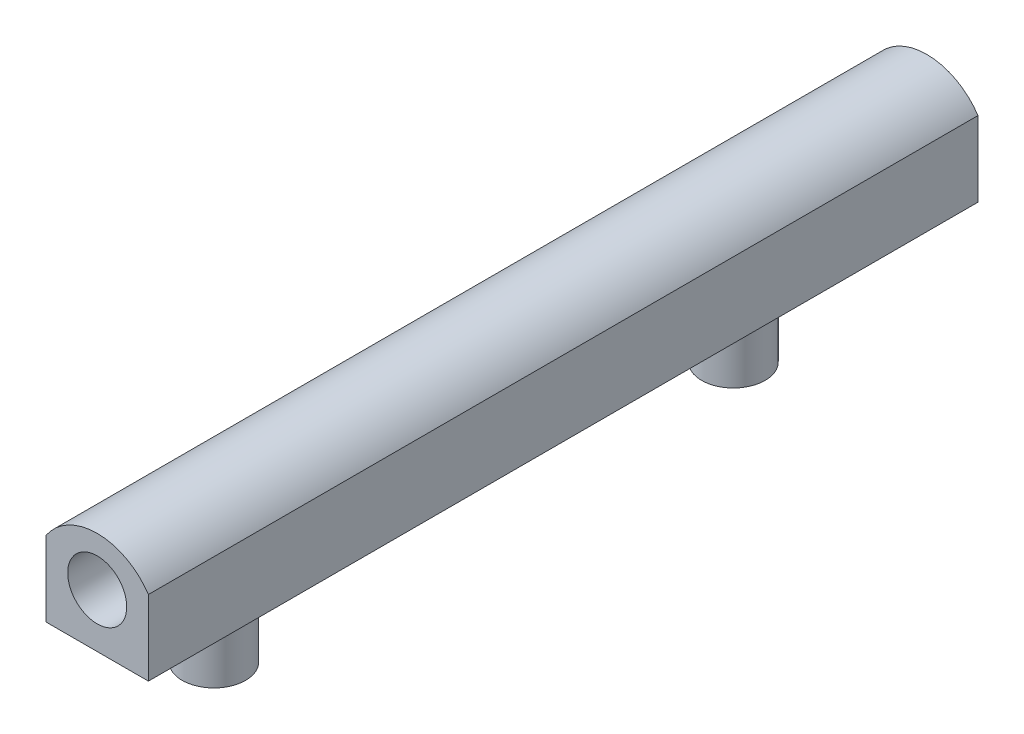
from build123d import *

# Parameters (mm, degrees)
SKETCH2_R                        = 1.1557
BOSS_EXTRUDE1_DEPTH              = 32.512
SKETCH3_R                        = 1.3843
CUT_EXTRUDE1_DEPTH               = 32.512
FILLET1_R                        = 0.127
SKETCH4_R                        = 1.2446
BOSS_EXTRUDE2_DEPTH              = 2.6416
F_97_0_0059_DIAMETER_HOLE1_D     = 1.27
F_97_0_0059_DIAMETER_HOLE1_DEPTH = 1.524
F_97_0_0059_DIAMETER_HOLE1_TIP   = 0.381546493
FILLET2_R                        = 0.381


with BuildPart() as part:
    # Sketch2 → Boss-Extrude1 (new body)
    with BuildSketch(Plane.XY):
        with BuildLine():
            Line((-2.0066, 0.844896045), (-2.0066, -2.0955))
            Line((-2.0066, -2.0955), (2.0066, -2.0955))
            Line((2.0066, -2.0955), (2.0066, 0.844896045))
            ThreePointArc((2.0066, 0.844896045), (0, 1.9177), (-2.0066, 0.844896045))
        make_face()
        Circle(SKETCH2_R, mode=Mode.SUBTRACT)
    extrude(amount=-BOSS_EXTRUDE1_DEPTH)

    # Sketch3 → Cut-Extrude1 (cut)
    with BuildSketch(Plane(origin=(0, 0, -4.572), x_dir=(-1, 0, 0), z_dir=(0, 0, -1))):
        Circle(SKETCH3_R)
    extrude(amount=CUT_EXTRUDE1_DEPTH, mode=Mode.SUBTRACT)

    # Fillet1
    fillet1_edges = [part.edges().sort_by_distance(p)[0] for p in [
        (1.3843, 0, -4.572),
    ]]
    fillet(fillet1_edges, radius=FILLET1_R)

    # Sketch4 → Boss-Extrude2 (add)
    with BuildSketch(Plane.XZ.offset(2.0955)):
        with Locations(Location((0, -4.572, 0), (0, 0, 270))):
            Circle(SKETCH4_R)
        with Locations(Location((0, -24.93264, 0), (0, 0, 270))):
            Circle(SKETCH4_R)
    extrude(amount=BOSS_EXTRUDE2_DEPTH)

    # 97 _0.0059_ Diameter Hole1
    with Locations(Plane.XZ.offset(4.7371)):
        with Locations((0, -24.93264), (0, -4.572)):
            Hole(F_97_0_0059_DIAMETER_HOLE1_D / 2, depth=F_97_0_0059_DIAMETER_HOLE1_DEPTH)
            with Locations((0, 0, -(F_97_0_0059_DIAMETER_HOLE1_DEPTH + F_97_0_0059_DIAMETER_HOLE1_TIP / 2))):  # 118° drill point
                Cone(0, F_97_0_0059_DIAMETER_HOLE1_D / 2, F_97_0_0059_DIAMETER_HOLE1_TIP, mode=Mode.SUBTRACT)

    # Fillet2
    fillet2_edges = [part.edges().sort_by_distance(p)[0] for p in [
        (0, -2.0955, -3.3274),
        (0, -2.0955, -23.68804),
    ]]
    fillet(fillet2_edges, radius=FILLET2_R)


solid = part.part
